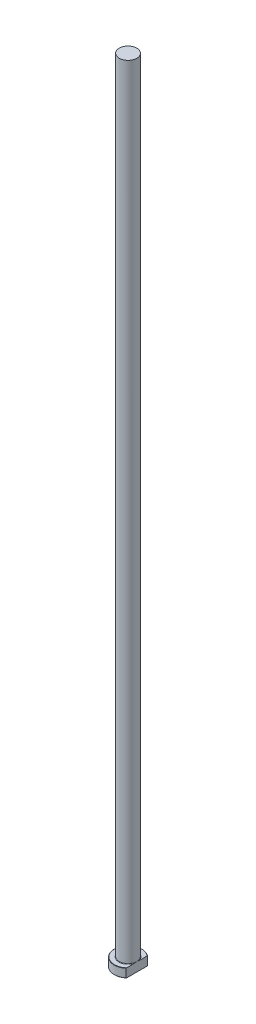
from build123d import *
from build123d.topology import SkipClean

# Parameters (mm, degrees)
CHAMFER1_SIZE = 0.2
FILLET1_R     = 0.3
KEY_DEPTH     = 631.192034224


with BuildPart() as part:
    # Sketch1 → Revolve1 (revolve)
    with BuildSketch(Plane.XY, mode=Mode.PRIVATE) as revolve1_sk:
        Polygon((0, 0), (-11, 0), (-11, 7), (-7, 7), (-7, 630), (0, 630), align=None)
    revolve(revolve1_sk.sketch.rotate(Axis((0, 259.958771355, 0), (0, -1, 0)), 270), axis=Axis((0, 259.958771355, 0), (0, -1, 0)))

    # Chamfer1
    chamfer1_edges = [part.edges().sort_by_distance(p)[0] for p in [
        (0, 7, -11),
        (0, 0, -11),
    ]]
    chamfer(chamfer1_edges, length=CHAMFER1_SIZE)

    # Fillet1
    fillet1_edges = [part.edges().sort_by_distance(p)[0] for p in [
        (0, 7, -7),
    ]]
    fillet(fillet1_edges, radius=FILLET1_R)

    # Sketch2 → KEY (cut, through all)
    with SkipClean():  # the faces are left unmerged after this step: merging them gives an invalid solid
        with BuildSketch(Plane(origin=(0, 0, 0), x_dir=(1, 0, 0), z_dir=(0, 1, 0))):
            with BuildLine():
                Line((7, 8.485281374), (7, -8.485281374))
                ThreePointArc((7, -8.485281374), (11, 0), (7, 8.485281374))
            make_face()
        extrude(amount=KEY_DEPTH, mode=Mode.SUBTRACT)


solid = part.part
